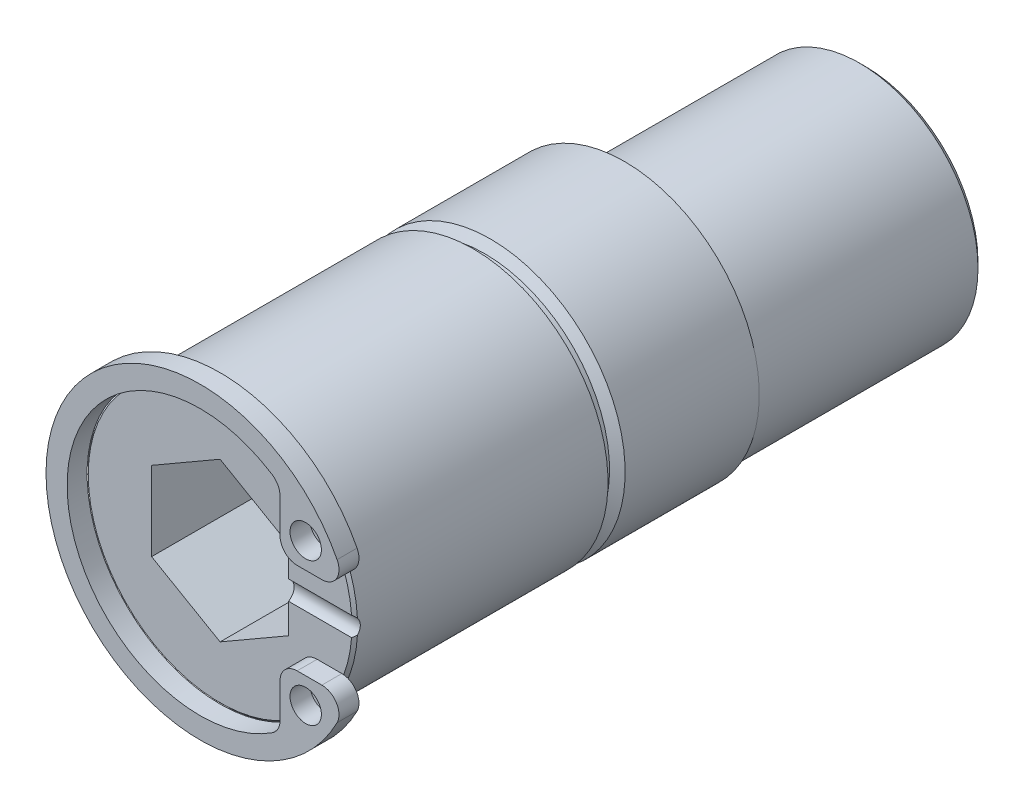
ISO-10303-21;
HEADER;
FILE_DESCRIPTION(('STEP AP214'),'2;1');
FILE_NAME('part.step','',(''),(''),'','','');
FILE_SCHEMA(('AUTOMOTIVE_DESIGN { 1 0 10303 214 1 1 1 1 }'));
ENDSEC;
DATA;
#1=APPLICATION_CONTEXT('core data for automotive mechanical design processes');
#2=APPLICATION_PROTOCOL_DEFINITION('international standard','automotive_design',2000,#1);
#3=PRODUCT_CONTEXT('',#1,'mechanical');
#4=PRODUCT('Part','Part','',(#3));
#5=PRODUCT_RELATED_PRODUCT_CATEGORY('part','',(#4));
#6=PRODUCT_DEFINITION_FORMATION('','',#4);
#7=PRODUCT_DEFINITION_CONTEXT('part definition',#1,'design');
#8=PRODUCT_DEFINITION('design','',#6,#7);
#9=PRODUCT_DEFINITION_SHAPE('','',#8);
#10=(LENGTH_UNIT() NAMED_UNIT(*) SI_UNIT(.MILLI.,.METRE.));
#11=(NAMED_UNIT(*) PLANE_ANGLE_UNIT() SI_UNIT($,.RADIAN.));
#12=(NAMED_UNIT(*) SI_UNIT($,.STERADIAN.) SOLID_ANGLE_UNIT());
#13=UNCERTAINTY_MEASURE_WITH_UNIT(LENGTH_MEASURE(1.E-05),#10,'distance_accuracy_value','');
#14=(GEOMETRIC_REPRESENTATION_CONTEXT(3) GLOBAL_UNCERTAINTY_ASSIGNED_CONTEXT((#13)) GLOBAL_UNIT_ASSIGNED_CONTEXT((#10,
#11,#12)) REPRESENTATION_CONTEXT('',''));
#15=CARTESIAN_POINT('',(0.,0.,0.));
#16=DIRECTION('',(0.,0.,1.));
#17=DIRECTION('',(1.,0.,0.));
#18=AXIS2_PLACEMENT_3D('',#15,#16,#17);
#19=CARTESIAN_POINT('',(4.31800000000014,2.79399999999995,0.));
#20=DIRECTION('',(0.,0.,1.));
#21=DIRECTION('',(0.,-1.,0.));
#22=AXIS2_PLACEMENT_3D('',#19,#20,#21);
#23=CYLINDRICAL_SURFACE('',#22,0.762);
#24=CARTESIAN_POINT('',(4.31800000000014,2.79399999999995,0.));
#25=DIRECTION('',(0.,0.,1.));
#26=DIRECTION('',(-1.,0.,0.));
#27=AXIS2_PLACEMENT_3D('',#24,#25,#26);
#28=CIRCLE('',#27,0.762);
#29=CARTESIAN_POINT('',(3.55600000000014,2.79399999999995,0.));
#30=VERTEX_POINT('',#29);
#31=CARTESIAN_POINT('',(4.31800000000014,2.03199999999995,0.));
#32=VERTEX_POINT('',#31);
#33=EDGE_CURVE('E242',#30,#32,#28,.T.);
#34=ORIENTED_EDGE('',*,*,#33,.T.);
#35=DIRECTION('',(0.,0.,1.));
#36=VECTOR('',#35,1.);
#37=CARTESIAN_POINT('',(4.31800000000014,2.032,0.));
#38=LINE('',#37,#36);
#39=CARTESIAN_POINT('',(4.31800000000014,2.032,0.889));
#40=VERTEX_POINT('',#39);
#41=EDGE_CURVE('E295',#32,#40,#38,.T.);
#42=ORIENTED_EDGE('',*,*,#41,.T.);
#43=CARTESIAN_POINT('',(4.31800000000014,2.79399999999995,0.889));
#44=DIRECTION('',(0.,0.,1.));
#45=DIRECTION('',(0.,-1.,0.));
#46=AXIS2_PLACEMENT_3D('',#43,#44,#45);
#47=CIRCLE('',#46,0.762);
#48=CARTESIAN_POINT('',(3.55600000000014,2.79399999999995,0.889));
#49=VERTEX_POINT('',#48);
#50=EDGE_CURVE('E267',#40,#49,#47,.F.);
#51=ORIENTED_EDGE('',*,*,#50,.T.);
#52=DIRECTION('',(0.,0.,1.));
#53=VECTOR('',#52,1.);
#54=CARTESIAN_POINT('',(3.55600000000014,2.79399999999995,0.));
#55=LINE('',#54,#53);
#56=EDGE_CURVE('E292',#49,#30,#55,.F.);
#57=ORIENTED_EDGE('',*,*,#56,.T.);
#58=EDGE_LOOP('',(#34,#42,#51,#57));
#59=FACE_BOUND('',#58,.T.);
#60=ADVANCED_FACE('F14',(#59),#23,.T.);
#61=CARTESIAN_POINT('',(3.55600000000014,4.33358540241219,0.));
#62=DIRECTION('',(1.,0.,0.));
#63=DIRECTION('',(0.,1.,0.));
#64=AXIS2_PLACEMENT_3D('',#61,#62,#63);
#65=PLANE('',#64);
#66=DIRECTION('',(0.,0.,1.));
#67=VECTOR('',#66,1.);
#68=CARTESIAN_POINT('',(3.55600000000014,4.33358540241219,0.));
#69=LINE('',#68,#67);
#70=CARTESIAN_POINT('',(3.55600000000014,4.33358540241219,0.889));
#71=VERTEX_POINT('',#70);
#72=CARTESIAN_POINT('',(3.55600000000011,4.33358540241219,0.));
#73=VERTEX_POINT('',#72);
#74=EDGE_CURVE('E291',#71,#73,#69,.F.);
#75=ORIENTED_EDGE('',*,*,#74,.T.);
#76=DIRECTION('',(0.,1.,0.));
#77=VECTOR('',#76,1.);
#78=CARTESIAN_POINT('',(3.55600000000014,0.,0.));
#79=LINE('',#78,#77);
#80=EDGE_CURVE('E239',#30,#73,#79,.T.);
#81=ORIENTED_EDGE('',*,*,#80,.F.);
#82=ORIENTED_EDGE('',*,*,#56,.F.);
#83=DIRECTION('',(0.,1.,0.));
#84=VECTOR('',#83,1.);
#85=CARTESIAN_POINT('',(3.55600000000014,-6.858,0.889));
#86=LINE('',#85,#84);
#87=EDGE_CURVE('E263',#49,#71,#86,.T.);
#88=ORIENTED_EDGE('',*,*,#87,.T.);
#89=EDGE_LOOP('',(#75,#81,#82,#88));
#90=FACE_BOUND('',#89,.T.);
#91=ADVANCED_FACE('F460',(#90),#65,.F.);
#92=CARTESIAN_POINT('',(3.55600000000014,-2.794,0.));
#93=DIRECTION('',(1.,0.,0.));
#94=DIRECTION('',(0.,1.,0.));
#95=AXIS2_PLACEMENT_3D('',#92,#93,#94);
#96=PLANE('',#95);
#97=DIRECTION('',(0.,0.,1.));
#98=VECTOR('',#97,1.);
#99=CARTESIAN_POINT('',(3.55600000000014,-2.794,0.));
#100=LINE('',#99,#98);
#101=CARTESIAN_POINT('',(3.55600000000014,-2.794,0.));
#102=VERTEX_POINT('',#101);
#103=CARTESIAN_POINT('',(3.55600000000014,-2.794,0.889));
#104=VERTEX_POINT('',#103);
#105=EDGE_CURVE('E280',#102,#104,#100,.T.);
#106=ORIENTED_EDGE('',*,*,#105,.F.);
#107=DIRECTION('',(0.,1.,0.));
#108=VECTOR('',#107,1.);
#109=CARTESIAN_POINT('',(3.55600000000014,0.,0.));
#110=LINE('',#109,#108);
#111=CARTESIAN_POINT('',(3.55600000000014,-4.33358540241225,0.));
#112=VERTEX_POINT('',#111);
#113=EDGE_CURVE('E228',#112,#102,#110,.T.);
#114=ORIENTED_EDGE('',*,*,#113,.F.);
#115=DIRECTION('',(0.,0.,1.));
#116=VECTOR('',#115,1.);
#117=CARTESIAN_POINT('',(3.55600000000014,-4.33358540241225,0.));
#118=LINE('',#117,#116);
#119=CARTESIAN_POINT('',(3.55600000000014,-4.33358540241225,0.889));
#120=VERTEX_POINT('',#119);
#121=EDGE_CURVE('E282',#120,#112,#118,.F.);
#122=ORIENTED_EDGE('',*,*,#121,.F.);
#123=DIRECTION('',(0.,1.,0.));
#124=VECTOR('',#123,1.);
#125=CARTESIAN_POINT('',(3.55600000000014,-6.858,0.889));
#126=LINE('',#125,#124);
#127=EDGE_CURVE('E259',#120,#104,#126,.T.);
#128=ORIENTED_EDGE('',*,*,#127,.T.);
#129=EDGE_LOOP('',(#106,#114,#122,#128));
#130=FACE_BOUND('',#129,.T.);
#131=ADVANCED_FACE('F466',(#130),#96,.F.);
#132=CARTESIAN_POINT('',(4.31800000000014,-2.794,0.));
#133=DIRECTION('',(0.,0.,1.));
#134=DIRECTION('',(1.,0.,0.));
#135=AXIS2_PLACEMENT_3D('',#132,#133,#134);
#136=CYLINDRICAL_SURFACE('',#135,0.762);
#137=CARTESIAN_POINT('',(4.31800000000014,-2.794,0.));
#138=DIRECTION('',(0.,0.,1.));
#139=DIRECTION('',(-1.,0.,0.));
#140=AXIS2_PLACEMENT_3D('',#137,#138,#139);
#141=CIRCLE('',#140,0.762);
#142=CARTESIAN_POINT('',(4.31800000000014,-2.032,0.));
#143=VERTEX_POINT('',#142);
#144=EDGE_CURVE('E224',#143,#102,#141,.T.);
#145=ORIENTED_EDGE('',*,*,#144,.T.);
#146=ORIENTED_EDGE('',*,*,#105,.T.);
#147=CARTESIAN_POINT('',(4.31800000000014,-2.794,0.889));
#148=DIRECTION('',(0.,0.,1.));
#149=DIRECTION('',(1.,0.,0.));
#150=AXIS2_PLACEMENT_3D('',#147,#148,#149);
#151=CIRCLE('',#150,0.762);
#152=CARTESIAN_POINT('',(4.31800000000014,-2.032,0.889));
#153=VERTEX_POINT('',#152);
#154=EDGE_CURVE('E258',#104,#153,#151,.F.);
#155=ORIENTED_EDGE('',*,*,#154,.T.);
#156=DIRECTION('',(0.,0.,-1.));
#157=VECTOR('',#156,1.);
#158=CARTESIAN_POINT('',(4.31800000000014,-2.032,0.));
#159=LINE('',#158,#157);
#160=EDGE_CURVE('E277',#153,#143,#159,.T.);
#161=ORIENTED_EDGE('',*,*,#160,.T.);
#162=EDGE_LOOP('',(#145,#146,#155,#161));
#163=FACE_BOUND('',#162,.T.);
#164=ADVANCED_FACE('F475',(#163),#136,.T.);
#165=CARTESIAN_POINT('',(4.31800000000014,2.032,0.));
#166=DIRECTION('',(0.,1.,0.));
#167=DIRECTION('',(0.,0.,1.));
#168=AXIS2_PLACEMENT_3D('',#165,#166,#167);
#169=PLANE('',#168);
#170=ORIENTED_EDGE('',*,*,#41,.F.);
#171=DIRECTION('',(-1.,0.,0.));
#172=VECTOR('',#171,1.);
#173=CARTESIAN_POINT('',(5.9944,2.032,0.));
#174=LINE('',#173,#172);
#175=CARTESIAN_POINT('',(5.41800516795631,2.032,0.));
#176=VERTEX_POINT('',#175);
#177=EDGE_CURVE('E244',#176,#32,#174,.T.);
#178=ORIENTED_EDGE('',*,*,#177,.F.);
#179=DIRECTION('',(0.,0.,1.));
#180=VECTOR('',#179,1.);
#181=CARTESIAN_POINT('',(5.41800516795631,2.032,0.));
#182=LINE('',#181,#180);
#183=CARTESIAN_POINT('',(5.41800516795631,2.032,0.889));
#184=VERTEX_POINT('',#183);
#185=EDGE_CURVE('E297',#184,#176,#182,.F.);
#186=ORIENTED_EDGE('',*,*,#185,.F.);
#187=DIRECTION('',(1.,0.,0.));
#188=VECTOR('',#187,1.);
#189=CARTESIAN_POINT('',(6.29140533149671,2.032,0.889));
#190=LINE('',#189,#188);
#191=EDGE_CURVE('E268',#184,#40,#190,.F.);
#192=ORIENTED_EDGE('',*,*,#191,.T.);
#193=EDGE_LOOP('',(#170,#178,#186,#192));
#194=FACE_BOUND('',#193,.T.);
#195=ADVANCED_FACE('F471',(#194),#169,.F.);
#196=CARTESIAN_POINT('',(5.41800516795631,-2.032,0.));
#197=DIRECTION('',(0.,-1.,0.));
#198=DIRECTION('',(0.,0.,-1.));
#199=AXIS2_PLACEMENT_3D('',#196,#197,#198);
#200=PLANE('',#199);
#201=DIRECTION('',(0.,0.,1.));
#202=VECTOR('',#201,1.);
#203=CARTESIAN_POINT('',(5.41800516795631,-2.032,0.));
#204=LINE('',#203,#202);
#205=CARTESIAN_POINT('',(5.41800516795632,-2.032,0.));
#206=VERTEX_POINT('',#205);
#207=CARTESIAN_POINT('',(5.4180051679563,-2.032,0.889));
#208=VERTEX_POINT('',#207);
#209=EDGE_CURVE('E275',#206,#208,#204,.T.);
#210=ORIENTED_EDGE('',*,*,#209,.F.);
#211=DIRECTION('',(1.,0.,0.));
#212=VECTOR('',#211,1.);
#213=CARTESIAN_POINT('',(5.9944,-2.032,0.));
#214=LINE('',#213,#212);
#215=EDGE_CURVE('E208',#143,#206,#214,.T.);
#216=ORIENTED_EDGE('',*,*,#215,.F.);
#217=ORIENTED_EDGE('',*,*,#160,.F.);
#218=DIRECTION('',(1.,0.,0.));
#219=VECTOR('',#218,1.);
#220=CARTESIAN_POINT('',(6.29140533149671,-2.032,0.889));
#221=LINE('',#220,#219);
#222=EDGE_CURVE('E255',#153,#208,#221,.T.);
#223=ORIENTED_EDGE('',*,*,#222,.T.);
#224=EDGE_LOOP('',(#210,#216,#217,#223));
#225=FACE_BOUND('',#224,.T.);
#226=ADVANCED_FACE('F474',(#225),#200,.F.);
#227=CARTESIAN_POINT('',(6.29140533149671,-6.858,0.889));
#228=DIRECTION('',(0.,0.,-1.));
#229=DIRECTION('',(0.,1.,0.));
#230=AXIS2_PLACEMENT_3D('',#227,#228,#229);
#231=PLANE('',#230);
#232=CARTESIAN_POINT('',(1.2659720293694E-13,0.,0.889));
#233=DIRECTION('',(0.,0.,1.));
#234=DIRECTION('',(0.,-1.,0.));
#235=AXIS2_PLACEMENT_3D('',#232,#233,#234);
#236=CIRCLE('',#235,6.858);
#237=CARTESIAN_POINT('',(6.09525581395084,-3.14325,0.889));
#238=VERTEX_POINT('',#237);
#239=CARTESIAN_POINT('',(6.09525581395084,3.14325,0.889));
#240=VERTEX_POINT('',#239);
#241=EDGE_CURVE('E317',#238,#240,#236,.F.);
#242=ORIENTED_EDGE('',*,*,#241,.F.);
#243=CARTESIAN_POINT('',(5.4180051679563,-2.794,0.889));
#244=DIRECTION('',(0.,0.,1.));
#245=DIRECTION('',(1.,0.,0.));
#246=AXIS2_PLACEMENT_3D('',#243,#244,#245);
#247=CIRCLE('',#246,0.762);
#248=EDGE_CURVE('E210',#208,#238,#247,.F.);
#249=ORIENTED_EDGE('',*,*,#248,.F.);
#250=ORIENTED_EDGE('',*,*,#222,.F.);
#251=ORIENTED_EDGE('',*,*,#154,.F.);
#252=ORIENTED_EDGE('',*,*,#127,.F.);
#253=CARTESIAN_POINT('',(2.79400000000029,-4.33358540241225,0.889));
#254=DIRECTION('',(0.,0.,1.));
#255=DIRECTION('',(1.,0.,0.));
#256=AXIS2_PLACEMENT_3D('',#253,#254,#255);
#257=CIRCLE('',#256,0.761999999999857);
#258=CARTESIAN_POINT('',(3.2069064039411,-4.97401674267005,0.889));
#259=VERTEX_POINT('',#258);
#260=EDGE_CURVE('E262',#259,#120,#257,.T.);
#261=ORIENTED_EDGE('',*,*,#260,.F.);
#262=CARTESIAN_POINT('',(1.25005070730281E-13,0.,0.889));
#263=DIRECTION('',(0.,0.,1.));
#264=DIRECTION('',(0.,-1.,0.));
#265=AXIS2_PLACEMENT_3D('',#262,#263,#264);
#266=CIRCLE('',#265,5.9182);
#267=CARTESIAN_POINT('',(3.20690640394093,4.9740167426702,0.889));
#268=VERTEX_POINT('',#267);
#269=EDGE_CURVE('E309',#268,#259,#266,.T.);
#270=ORIENTED_EDGE('',*,*,#269,.F.);
#271=CARTESIAN_POINT('',(2.794,4.33358540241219,0.889));
#272=DIRECTION('',(0.,0.,1.));
#273=DIRECTION('',(1.,0.,0.));
#274=AXIS2_PLACEMENT_3D('',#271,#272,#273);
#275=CIRCLE('',#274,0.762000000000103);
#276=EDGE_CURVE('E266',#71,#268,#275,.T.);
#277=ORIENTED_EDGE('',*,*,#276,.F.);
#278=ORIENTED_EDGE('',*,*,#87,.F.);
#279=ORIENTED_EDGE('',*,*,#50,.F.);
#280=ORIENTED_EDGE('',*,*,#191,.F.);
#281=CARTESIAN_POINT('',(5.41800516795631,2.794,0.889));
#282=DIRECTION('',(0.,0.,1.));
#283=DIRECTION('',(0.,-1.,0.));
#284=AXIS2_PLACEMENT_3D('',#281,#282,#283);
#285=CIRCLE('',#284,0.762);
#286=EDGE_CURVE('E271',#240,#184,#285,.F.);
#287=ORIENTED_EDGE('',*,*,#286,.F.);
#288=EDGE_LOOP('',(#242,#249,#250,#251,#252,#261,#270,#277,#278,#279,#280,#287));
#289=FACE_BOUND('',#288,.T.);
#290=CARTESIAN_POINT('',(4.69900000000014,3.175,0.889));
#291=DIRECTION('',(0.,0.,-1.));
#292=DIRECTION('',(0.,1.,0.));
#293=AXIS2_PLACEMENT_3D('',#290,#291,#292);
#294=CIRCLE('',#293,0.6985);
#295=CARTESIAN_POINT('',(4.69900000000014,3.8735,0.889000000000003));
#296=VERTEX_POINT('',#295);
#297=EDGE_CURVE('E319',#296,#296,#294,.F.);
#298=ORIENTED_EDGE('',*,*,#297,.F.);
#299=EDGE_LOOP('',(#298));
#300=FACE_BOUND('',#299,.T.);
#301=CARTESIAN_POINT('',(4.69900000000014,-3.175,0.889));
#302=DIRECTION('',(0.,0.,-1.));
#303=DIRECTION('',(0.,1.,0.));
#304=AXIS2_PLACEMENT_3D('',#301,#302,#303);
#305=CIRCLE('',#304,0.6985);
#306=CARTESIAN_POINT('',(4.69900000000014,-2.4765,0.889000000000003));
#307=VERTEX_POINT('',#306);
#308=EDGE_CURVE('E273',#307,#307,#305,.F.);
#309=ORIENTED_EDGE('',*,*,#308,.F.);
#310=EDGE_LOOP('',(#309));
#311=FACE_BOUND('',#310,.T.);
#312=ADVANCED_FACE('F591',(#289,#300,#311),#231,.F.);
#313=CARTESIAN_POINT('',(1.25005070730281E-13,0.,0.));
#314=DIRECTION('',(0.,0.,1.));
#315=DIRECTION('',(0.,-1.,0.));
#316=AXIS2_PLACEMENT_3D('',#313,#314,#315);
#317=CYLINDRICAL_SURFACE('',#316,5.9182);
#318=CARTESIAN_POINT('',(1.25005070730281E-13,0.,0.));
#319=DIRECTION('',(0.,0.,1.));
#320=DIRECTION('',(-1.,0.,0.));
#321=AXIS2_PLACEMENT_3D('',#318,#319,#320);
#322=CIRCLE('',#321,5.9182);
#323=CARTESIAN_POINT('',(3.20690640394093,4.9740167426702,0.));
#324=VERTEX_POINT('',#323);
#325=CARTESIAN_POINT('',(3.20690640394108,-4.97401674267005,0.));
#326=VERTEX_POINT('',#325);
#327=EDGE_CURVE('E234',#324,#326,#322,.T.);
#328=ORIENTED_EDGE('',*,*,#327,.F.);
#329=DIRECTION('',(0.,0.,1.));
#330=VECTOR('',#329,1.);
#331=CARTESIAN_POINT('',(3.20690640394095,4.97401674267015,0.));
#332=LINE('',#331,#330);
#333=EDGE_CURVE('E288',#268,#324,#332,.F.);
#334=ORIENTED_EDGE('',*,*,#333,.F.);
#335=ORIENTED_EDGE('',*,*,#269,.T.);
#336=DIRECTION('',(0.,0.,1.));
#337=VECTOR('',#336,1.);
#338=CARTESIAN_POINT('',(3.20690640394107,-4.9740167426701,0.));
#339=LINE('',#338,#337);
#340=EDGE_CURVE('E285',#259,#326,#339,.F.);
#341=ORIENTED_EDGE('',*,*,#340,.T.);
#342=EDGE_LOOP('',(#328,#334,#335,#341));
#343=FACE_BOUND('',#342,.T.);
#344=ADVANCED_FACE('F600',(#343),#317,.F.);
#345=CARTESIAN_POINT('',(2.794,4.33358540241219,0.));
#346=DIRECTION('',(0.,0.,1.));
#347=DIRECTION('',(1.,0.,0.));
#348=AXIS2_PLACEMENT_3D('',#345,#346,#347);
#349=CYLINDRICAL_SURFACE('',#348,0.762000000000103);
#350=ORIENTED_EDGE('',*,*,#333,.T.);
#351=CARTESIAN_POINT('',(2.794,4.33358540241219,0.));
#352=DIRECTION('',(0.,0.,1.));
#353=DIRECTION('',(-1.,0.,0.));
#354=AXIS2_PLACEMENT_3D('',#351,#352,#353);
#355=CIRCLE('',#354,0.762000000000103);
#356=CARTESIAN_POINT('',(3.42063754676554,4.76713976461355,0.));
#357=VERTEX_POINT('',#356);
#358=EDGE_CURVE('E236',#357,#324,#355,.T.);
#359=ORIENTED_EDGE('',*,*,#358,.F.);
#360=EDGE_CURVE('E237',#73,#357,#355,.T.);
#361=ORIENTED_EDGE('',*,*,#360,.F.);
#362=ORIENTED_EDGE('',*,*,#74,.F.);
#363=ORIENTED_EDGE('',*,*,#276,.T.);
#364=EDGE_LOOP('',(#350,#359,#361,#362,#363));
#365=FACE_BOUND('',#364,.T.);
#366=ADVANCED_FACE('F485',(#365),#349,.F.);
#367=CARTESIAN_POINT('',(4.69900000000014,3.175,0.889));
#368=DIRECTION('',(0.,0.,-1.));
#369=DIRECTION('',(0.,1.,0.));
#370=AXIS2_PLACEMENT_3D('',#367,#368,#369);
#371=CYLINDRICAL_SURFACE('',#370,0.6985);
#372=CARTESIAN_POINT('',(4.69900000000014,3.175,0.));
#373=DIRECTION('',(0.,0.,1.));
#374=DIRECTION('',(-1.,0.,0.));
#375=AXIS2_PLACEMENT_3D('',#372,#373,#374);
#376=CIRCLE('',#375,0.6985);
#377=CARTESIAN_POINT('',(5.20992876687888,2.69870802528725,0.));
#378=VERTEX_POINT('',#377);
#379=CARTESIAN_POINT('',(4.44774164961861,3.82674495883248,0.));
#380=VERTEX_POINT('',#379);
#381=EDGE_CURVE('E250',#378,#380,#376,.T.);
#382=ORIENTED_EDGE('',*,*,#381,.F.);
#383=EDGE_CURVE('E33',#380,#378,#376,.T.);
#384=ORIENTED_EDGE('',*,*,#383,.F.);
#385=EDGE_LOOP('',(#382,#384));
#386=FACE_BOUND('',#385,.T.);
#387=ORIENTED_EDGE('',*,*,#297,.T.);
#388=EDGE_LOOP('',(#387));
#389=FACE_BOUND('',#388,.T.);
#390=ADVANCED_FACE('F481',(#386,#389),#371,.F.);
#391=CARTESIAN_POINT('',(5.41800516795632,2.794,0.));
#392=DIRECTION('',(0.,0.,1.));
#393=DIRECTION('',(0.,-1.,0.));
#394=AXIS2_PLACEMENT_3D('',#391,#392,#393);
#395=CYLINDRICAL_SURFACE('',#394,0.762);
#396=CARTESIAN_POINT('',(5.41800516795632,2.794,0.));
#397=DIRECTION('',(0.,0.,1.));
#398=DIRECTION('',(-1.,0.,0.));
#399=AXIS2_PLACEMENT_3D('',#396,#397,#398);
#400=CIRCLE('',#399,0.762);
#401=CARTESIAN_POINT('',(5.50256398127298,2.03670626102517,0.));
#402=VERTEX_POINT('',#401);
#403=EDGE_CURVE('E248',#176,#402,#400,.T.);
#404=ORIENTED_EDGE('',*,*,#403,.T.);
#405=CARTESIAN_POINT('',(6.09525581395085,3.14325,0.));
#406=VERTEX_POINT('',#405);
#407=EDGE_CURVE('E247',#402,#406,#400,.T.);
#408=ORIENTED_EDGE('',*,*,#407,.T.);
#409=DIRECTION('',(0.,0.,1.));
#410=VECTOR('',#409,1.);
#411=CARTESIAN_POINT('',(6.09525581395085,3.14325,0.));
#412=LINE('',#411,#410);
#413=EDGE_CURVE('E300',#406,#240,#412,.T.);
#414=ORIENTED_EDGE('',*,*,#413,.T.);
#415=ORIENTED_EDGE('',*,*,#286,.T.);
#416=ORIENTED_EDGE('',*,*,#185,.T.);
#417=EDGE_LOOP('',(#404,#408,#414,#415,#416));
#418=FACE_BOUND('',#417,.T.);
#419=ADVANCED_FACE('F477',(#418),#395,.T.);
#420=CARTESIAN_POINT('',(1.2659720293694E-13,0.,0.));
#421=DIRECTION('',(0.,0.,1.));
#422=DIRECTION('',(0.,-1.,0.));
#423=AXIS2_PLACEMENT_3D('',#420,#421,#422);
#424=CYLINDRICAL_SURFACE('',#423,6.858);
#425=DIRECTION('',(0.,0.,1.));
#426=VECTOR('',#425,1.);
#427=CARTESIAN_POINT('',(6.09525581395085,-3.14325,0.));
#428=LINE('',#427,#426);
#429=CARTESIAN_POINT('',(6.09525581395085,-3.14325,0.));
#430=VERTEX_POINT('',#429);
#431=EDGE_CURVE('E223',#430,#238,#428,.T.);
#432=ORIENTED_EDGE('',*,*,#431,.T.);
#433=ORIENTED_EDGE('',*,*,#241,.T.);
#434=ORIENTED_EDGE('',*,*,#413,.F.);
#435=CARTESIAN_POINT('',(1.2659720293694E-13,0.,0.));
#436=DIRECTION('',(0.,0.,1.));
#437=DIRECTION('',(0.,-1.,0.));
#438=AXIS2_PLACEMENT_3D('',#435,#436,#437);
#439=CIRCLE('',#438,6.858);
#440=EDGE_CURVE('E274',#406,#430,#439,.T.);
#441=ORIENTED_EDGE('',*,*,#440,.T.);
#442=EDGE_LOOP('',(#432,#433,#434,#441));
#443=FACE_BOUND('',#442,.T.);
#444=ADVANCED_FACE('F480',(#443),#424,.T.);
#445=CARTESIAN_POINT('',(5.41800516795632,-2.794,0.));
#446=DIRECTION('',(0.,0.,1.));
#447=DIRECTION('',(1.,0.,0.));
#448=AXIS2_PLACEMENT_3D('',#445,#446,#447);
#449=CYLINDRICAL_SURFACE('',#448,0.762);
#450=ORIENTED_EDGE('',*,*,#248,.T.);
#451=ORIENTED_EDGE('',*,*,#431,.F.);
#452=CARTESIAN_POINT('',(5.41800516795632,-2.794,0.));
#453=DIRECTION('',(0.,0.,1.));
#454=DIRECTION('',(-1.,0.,0.));
#455=AXIS2_PLACEMENT_3D('',#452,#453,#454);
#456=CIRCLE('',#455,0.762);
#457=CARTESIAN_POINT('',(5.50256398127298,-2.03670626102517,0.));
#458=VERTEX_POINT('',#457);
#459=EDGE_CURVE('E193',#430,#458,#456,.T.);
#460=ORIENTED_EDGE('',*,*,#459,.T.);
#461=EDGE_CURVE('E102',#458,#206,#456,.T.);
#462=ORIENTED_EDGE('',*,*,#461,.T.);
#463=ORIENTED_EDGE('',*,*,#209,.T.);
#464=EDGE_LOOP('',(#450,#451,#460,#462,#463));
#465=FACE_BOUND('',#464,.T.);
#466=ADVANCED_FACE('F221',(#465),#449,.T.);
#467=CARTESIAN_POINT('',(4.69900000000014,-3.175,0.889));
#468=DIRECTION('',(0.,0.,-1.));
#469=DIRECTION('',(0.,1.,0.));
#470=AXIS2_PLACEMENT_3D('',#467,#468,#469);
#471=CYLINDRICAL_SURFACE('',#470,0.6985);
#472=ORIENTED_EDGE('',*,*,#308,.T.);
#473=EDGE_LOOP('',(#472));
#474=FACE_BOUND('',#473,.T.);
#475=CARTESIAN_POINT('',(4.69900000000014,-3.175,0.));
#476=DIRECTION('',(0.,0.,1.));
#477=DIRECTION('',(-1.,0.,0.));
#478=AXIS2_PLACEMENT_3D('',#475,#476,#477);
#479=CIRCLE('',#478,0.6985);
#480=CARTESIAN_POINT('',(4.44774164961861,-3.82674495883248,0.));
#481=VERTEX_POINT('',#480);
#482=CARTESIAN_POINT('',(5.20992876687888,-2.69870802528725,0.));
#483=VERTEX_POINT('',#482);
#484=EDGE_CURVE('E196',#481,#483,#479,.T.);
#485=ORIENTED_EDGE('',*,*,#484,.F.);
#486=EDGE_CURVE('E253',#483,#481,#479,.T.);
#487=ORIENTED_EDGE('',*,*,#486,.F.);
#488=EDGE_LOOP('',(#485,#487));
#489=FACE_BOUND('',#488,.T.);
#490=ADVANCED_FACE('F486',(#474,#489),#471,.F.);
#491=CARTESIAN_POINT('',(2.79400000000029,-4.3335854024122,0.));
#492=DIRECTION('',(0.,0.,1.));
#493=DIRECTION('',(1.,0.,0.));
#494=AXIS2_PLACEMENT_3D('',#491,#492,#493);
#495=CYLINDRICAL_SURFACE('',#494,0.761999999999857);
#496=ORIENTED_EDGE('',*,*,#121,.T.);
#497=CARTESIAN_POINT('',(2.79400000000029,-4.3335854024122,0.));
#498=DIRECTION('',(0.,0.,1.));
#499=DIRECTION('',(-1.,0.,0.));
#500=AXIS2_PLACEMENT_3D('',#497,#498,#499);
#501=CIRCLE('',#500,0.761999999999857);
#502=CARTESIAN_POINT('',(3.42063754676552,-4.76713976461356,0.));
#503=VERTEX_POINT('',#502);
#504=EDGE_CURVE('E231',#503,#112,#501,.T.);
#505=ORIENTED_EDGE('',*,*,#504,.F.);
#506=EDGE_CURVE('E232',#326,#503,#501,.T.);
#507=ORIENTED_EDGE('',*,*,#506,.F.);
#508=ORIENTED_EDGE('',*,*,#340,.F.);
#509=ORIENTED_EDGE('',*,*,#260,.T.);
#510=EDGE_LOOP('',(#496,#505,#507,#508,#509));
#511=FACE_BOUND('',#510,.T.);
#512=ADVANCED_FACE('F457',(#511),#495,.F.);
#513=CARTESIAN_POINT('',(-7.69597987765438,-6.858,0.));
#514=DIRECTION('',(0.,0.,1.));
#515=DIRECTION('',(0.,-1.,0.));
#516=AXIS2_PLACEMENT_3D('',#513,#514,#515);
#517=PLANE('',#516);
#518=ORIENTED_EDGE('',*,*,#506,.T.);
#519=CARTESIAN_POINT('',(0.,0.,0.));
#520=DIRECTION('',(0.,0.,1.));
#521=DIRECTION('',(0.,-1.,0.));
#522=AXIS2_PLACEMENT_3D('',#519,#520,#521);
#523=CIRCLE('',#522,5.86740000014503);
#524=EDGE_CURVE('E9',#503,#481,#523,.T.);
#525=ORIENTED_EDGE('',*,*,#524,.T.);
#526=ORIENTED_EDGE('',*,*,#484,.T.);
#527=EDGE_CURVE('E24',#483,#458,#523,.T.);
#528=ORIENTED_EDGE('',*,*,#527,.T.);
#529=ORIENTED_EDGE('',*,*,#459,.F.);
#530=ORIENTED_EDGE('',*,*,#440,.F.);
#531=ORIENTED_EDGE('',*,*,#407,.F.);
#532=EDGE_CURVE('E200',#402,#378,#523,.T.);
#533=ORIENTED_EDGE('',*,*,#532,.T.);
#534=ORIENTED_EDGE('',*,*,#381,.T.);
#535=EDGE_CURVE('E26',#380,#357,#523,.T.);
#536=ORIENTED_EDGE('',*,*,#535,.T.);
#537=ORIENTED_EDGE('',*,*,#358,.T.);
#538=ORIENTED_EDGE('',*,*,#327,.T.);
#539=EDGE_LOOP('',(#518,#525,#526,#528,#529,#530,#531,#533,#534,#536,#537,#538));
#540=FACE_BOUND('',#539,.T.);
#541=ADVANCED_FACE('F191',(#540),#517,.F.);
#542=CARTESIAN_POINT('',(0.7112,0.,-28.));
#543=DIRECTION('',(0.,0.,-1.));
#544=DIRECTION('',(0.,1.,0.));
#545=AXIS2_PLACEMENT_3D('',#542,#543,#544);
#546=PLANE('',#545);
#547=CARTESIAN_POINT('',(0.7112,0.,-27.9999999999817));
#548=DIRECTION('',(0.,0.,1.));
#549=DIRECTION('',(1.,0.,0.));
#550=AXIS2_PLACEMENT_3D('',#547,#548,#549);
#551=CIRCLE('',#550,5.01650000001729);
#552=CARTESIAN_POINT('',(5.72770000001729,0.,-27.9999999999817));
#553=VERTEX_POINT('',#552);
#554=EDGE_CURVE('E18',#553,#553,#551,.T.);
#555=ORIENTED_EDGE('',*,*,#554,.F.);
#556=EDGE_LOOP('',(#555));
#557=FACE_BOUND('',#556,.T.);
#558=ADVANCED_FACE('F16',(#557),#546,.T.);
#559=CARTESIAN_POINT('',(0.7112,0.,-27.7459999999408));
#560=DIRECTION('',(0.,0.,1.));
#561=DIRECTION('',(1.,0.,0.));
#562=AXIS2_PLACEMENT_3D('',#559,#560,#561);
#563=CONICAL_SURFACE('',#562,5.27050000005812,0.785398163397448);
#564=CARTESIAN_POINT('',(0.7112,0.,-27.746));
#565=DIRECTION('',(0.,0.,1.));
#566=DIRECTION('',(0.,-1.,0.));
#567=AXIS2_PLACEMENT_3D('',#564,#565,#566);
#568=CIRCLE('',#567,5.2705);
#569=CARTESIAN_POINT('',(0.711199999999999,-5.2705,-27.746));
#570=VERTEX_POINT('',#569);
#571=EDGE_CURVE('E396',#570,#570,#568,.T.);
#572=ORIENTED_EDGE('',*,*,#571,.F.);
#573=EDGE_LOOP('',(#572));
#574=FACE_BOUND('',#573,.T.);
#575=ORIENTED_EDGE('',*,*,#554,.T.);
#576=EDGE_LOOP('',(#575));
#577=FACE_BOUND('',#576,.T.);
#578=ADVANCED_FACE('F443',(#574,#577),#563,.T.);
#579=CARTESIAN_POINT('',(0.7112,0.,-28.));
#580=DIRECTION('',(0.,0.,1.));
#581=DIRECTION('',(0.,-1.,0.));
#582=AXIS2_PLACEMENT_3D('',#579,#580,#581);
#583=CYLINDRICAL_SURFACE('',#582,5.2705);
#584=CARTESIAN_POINT('',(0.7112,0.,-18.));
#585=DIRECTION('',(0.,0.,1.));
#586=DIRECTION('',(0.,-1.,0.));
#587=AXIS2_PLACEMENT_3D('',#584,#585,#586);
#588=CIRCLE('',#587,5.2705);
#589=CARTESIAN_POINT('',(0.711199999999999,-5.2705,-18.));
#590=VERTEX_POINT('',#589);
#591=EDGE_CURVE('E383',#590,#590,#588,.T.);
#592=ORIENTED_EDGE('',*,*,#591,.F.);
#593=EDGE_LOOP('',(#592));
#594=FACE_BOUND('',#593,.T.);
#595=ORIENTED_EDGE('',*,*,#571,.T.);
#596=EDGE_LOOP('',(#595));
#597=FACE_BOUND('',#596,.T.);
#598=ADVANCED_FACE('F440',(#594,#597),#583,.T.);
#599=CARTESIAN_POINT('',(0.,0.,-18.));
#600=DIRECTION('',(0.,0.,-1.));
#601=DIRECTION('',(0.,1.,0.));
#602=AXIS2_PLACEMENT_3D('',#599,#600,#601);
#603=PLANE('',#602);
#604=ORIENTED_EDGE('',*,*,#591,.T.);
#605=EDGE_LOOP('',(#604));
#606=FACE_BOUND('',#605,.T.);
#607=CARTESIAN_POINT('',(0.,0.,-18.));
#608=DIRECTION('',(0.,0.,-1.));
#609=DIRECTION('',(0.,1.,0.));
#610=AXIS2_PLACEMENT_3D('',#607,#608,#609);
#611=CIRCLE('',#610,5.9944);
#612=CARTESIAN_POINT('',(0.,5.9944,-18.));
#613=VERTEX_POINT('',#612);
#614=EDGE_CURVE('E378',#613,#613,#611,.F.);
#615=ORIENTED_EDGE('',*,*,#614,.F.);
#616=EDGE_LOOP('',(#615));
#617=FACE_BOUND('',#616,.T.);
#618=ADVANCED_FACE('F437',(#606,#617),#603,.T.);
#619=CARTESIAN_POINT('',(0.,0.,-1.44704514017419));
#620=DIRECTION('',(0.,0.,-1.));
#621=DIRECTION('',(0.,1.,0.));
#622=AXIS2_PLACEMENT_3D('',#619,#620,#621);
#623=CYLINDRICAL_SURFACE('',#622,5.9944);
#624=CARTESIAN_POINT('',(0.,0.,-12.0310000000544));
#625=DIRECTION('',(0.,0.,-1.));
#626=DIRECTION('',(0.,1.,0.));
#627=AXIS2_PLACEMENT_3D('',#624,#625,#626);
#628=CIRCLE('',#627,5.9944000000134);
#629=CARTESIAN_POINT('',(0.,5.9944000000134,-12.0310000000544));
#630=VERTEX_POINT('',#629);
#631=EDGE_CURVE('E352',#630,#630,#628,.F.);
#632=ORIENTED_EDGE('',*,*,#631,.F.);
#633=EDGE_LOOP('',(#632));
#634=FACE_BOUND('',#633,.T.);
#635=ORIENTED_EDGE('',*,*,#614,.T.);
#636=EDGE_LOOP('',(#635));
#637=FACE_BOUND('',#636,.T.);
#638=ADVANCED_FACE('F500',(#634,#637),#623,.T.);
#639=CARTESIAN_POINT('',(0.,0.,-12.0309999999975));
#640=DIRECTION('',(0.,0.,-1.));
#641=DIRECTION('',(0.,1.,0.));
#642=AXIS2_PLACEMENT_3D('',#639,#640,#641);
#643=CONICAL_SURFACE('',#642,5.99439999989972,1.04719755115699);
#644=ORIENTED_EDGE('',*,*,#631,.T.);
#645=EDGE_LOOP('',(#644));
#646=FACE_BOUND('',#645,.T.);
#647=CARTESIAN_POINT('',(0.,0.,-11.777));
#648=DIRECTION('',(0.,0.,-1.));
#649=DIRECTION('',(0.,1.,0.));
#650=AXIS2_PLACEMENT_3D('',#647,#648,#649);
#651=CIRCLE('',#650,5.55445909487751);
#652=CARTESIAN_POINT('',(0.,5.55445909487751,-11.777));
#653=VERTEX_POINT('',#652);
#654=EDGE_CURVE('E386',#653,#653,#651,.F.);
#655=ORIENTED_EDGE('',*,*,#654,.F.);
#656=EDGE_LOOP('',(#655));
#657=FACE_BOUND('',#656,.T.);
#658=ADVANCED_FACE('F696',(#646,#657),#643,.T.);
#659=CARTESIAN_POINT('',(0.,0.,-1.44704514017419));
#660=DIRECTION('',(0.,0.,-1.));
#661=DIRECTION('',(0.,1.,0.));
#662=AXIS2_PLACEMENT_3D('',#659,#660,#661);
#663=CYLINDRICAL_SURFACE('',#662,5.55445909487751);
#664=ORIENTED_EDGE('',*,*,#654,.T.);
#665=EDGE_LOOP('',(#664));
#666=FACE_BOUND('',#665,.T.);
#667=CARTESIAN_POINT('',(0.,0.,-11.5229999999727));
#668=DIRECTION('',(0.,0.,1.));
#669=DIRECTION('',(0.,-1.,0.));
#670=AXIS2_PLACEMENT_3D('',#667,#668,#669);
#671=CIRCLE('',#670,5.55445909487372);
#672=CARTESIAN_POINT('',(0.,-5.55445909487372,-11.5229999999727));
#673=VERTEX_POINT('',#672);
#674=EDGE_CURVE('E216',#673,#673,#671,.T.);
#675=ORIENTED_EDGE('',*,*,#674,.F.);
#676=EDGE_LOOP('',(#675));
#677=FACE_BOUND('',#676,.T.);
#678=ADVANCED_FACE('F423',(#666,#677),#663,.T.);
#679=CARTESIAN_POINT('',(0.,-27.6098,-6.096));
#680=DIRECTION('',(0.,0.,1.));
#681=DIRECTION('',(0.,-1.,0.));
#682=AXIS2_PLACEMENT_3D('',#679,#680,#681);
#683=PLANE('',#682);
#684=DIRECTION('',(0.,-1.,0.));
#685=VECTOR('',#684,1.);
#686=CARTESIAN_POINT('',(3.048,-27.6098,-6.096));
#687=LINE('',#686,#685);
#688=CARTESIAN_POINT('',(3.04800000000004,-1.75976362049,-6.096));
#689=VERTEX_POINT('',#688);
#690=CARTESIAN_POINT('',(3.04800000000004,1.75976362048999,-6.096));
#691=VERTEX_POINT('',#690);
#692=EDGE_CURVE('E375',#689,#691,#687,.F.);
#693=ORIENTED_EDGE('',*,*,#692,.T.);
#694=DIRECTION('',(-0.866025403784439,0.5,0.));
#695=VECTOR('',#694,1.);
#696=CARTESIAN_POINT('',(3.04800000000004,1.75976362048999,-6.096));
#697=LINE('',#696,#695);
#698=CARTESIAN_POINT('',(0.,3.51952724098,-6.096));
#699=VERTEX_POINT('',#698);
#700=EDGE_CURVE('E355',#691,#699,#697,.T.);
#701=ORIENTED_EDGE('',*,*,#700,.T.);
#702=DIRECTION('',(-0.866025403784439,-0.5,0.));
#703=VECTOR('',#702,1.);
#704=CARTESIAN_POINT('',(0.,3.51952724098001,-6.096));
#705=LINE('',#704,#703);
#706=CARTESIAN_POINT('',(-3.04800000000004,1.75976362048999,-6.096));
#707=VERTEX_POINT('',#706);
#708=EDGE_CURVE('E360',#699,#707,#705,.T.);
#709=ORIENTED_EDGE('',*,*,#708,.T.);
#710=DIRECTION('',(0.,-1.,0.));
#711=VECTOR('',#710,1.);
#712=CARTESIAN_POINT('',(-3.04800000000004,1.75976362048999,-6.096));
#713=LINE('',#712,#711);
#714=CARTESIAN_POINT('',(-3.04800000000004,-1.75976362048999,-6.096));
#715=VERTEX_POINT('',#714);
#716=EDGE_CURVE('E364',#707,#715,#713,.T.);
#717=ORIENTED_EDGE('',*,*,#716,.T.);
#718=DIRECTION('',(0.866025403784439,-0.5,0.));
#719=VECTOR('',#718,1.);
#720=CARTESIAN_POINT('',(-3.04800000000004,-1.75976362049,-6.096));
#721=LINE('',#720,#719);
#722=CARTESIAN_POINT('',(0.,-3.51952724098,-6.096));
#723=VERTEX_POINT('',#722);
#724=EDGE_CURVE('E368',#715,#723,#721,.T.);
#725=ORIENTED_EDGE('',*,*,#724,.T.);
#726=DIRECTION('',(0.866025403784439,0.5,0.));
#727=VECTOR('',#726,1.);
#728=CARTESIAN_POINT('',(0.,-3.51952724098,-6.096));
#729=LINE('',#728,#727);
#730=EDGE_CURVE('E371',#723,#689,#729,.T.);
#731=ORIENTED_EDGE('',*,*,#730,.T.);
#732=EDGE_LOOP('',(#693,#701,#709,#717,#725,#731));
#733=FACE_BOUND('',#732,.T.);
#734=ADVANCED_FACE('F504',(#733),#683,.T.);
#735=CARTESIAN_POINT('',(0.,0.,-11.2689999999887));
#736=DIRECTION('',(0.,0.,1.));
#737=DIRECTION('',(0.,-1.,0.));
#738=AXIS2_PLACEMENT_3D('',#735,#736,#737);
#739=CONICAL_SURFACE('',#738,5.99439999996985,1.04719755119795);
#740=CARTESIAN_POINT('',(0.,0.,-11.269));
#741=DIRECTION('',(0.,0.,-1.));
#742=DIRECTION('',(0.,1.,0.));
#743=AXIS2_PLACEMENT_3D('',#740,#741,#742);
#744=CIRCLE('',#743,5.9944);
#745=CARTESIAN_POINT('',(0.,5.9944,-11.269));
#746=VERTEX_POINT('',#745);
#747=EDGE_CURVE('E303',#746,#746,#744,.F.);
#748=ORIENTED_EDGE('',*,*,#747,.F.);
#749=EDGE_LOOP('',(#748));
#750=FACE_BOUND('',#749,.T.);
#751=ORIENTED_EDGE('',*,*,#674,.T.);
#752=EDGE_LOOP('',(#751));
#753=FACE_BOUND('',#752,.T.);
#754=ADVANCED_FACE('F424',(#750,#753),#739,.T.);
#755=CARTESIAN_POINT('',(3.04800000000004,1.75976362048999,-6.096));
#756=DIRECTION('',(0.5,0.866025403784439,0.));
#757=DIRECTION('',(-0.866025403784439,0.5,0.));
#758=AXIS2_PLACEMENT_3D('',#755,#756,#757);
#759=PLANE('',#758);
#760=DIRECTION('',(0.,0.,1.));
#761=VECTOR('',#760,1.);
#762=CARTESIAN_POINT('',(0.,3.51952724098,-6.096));
#763=LINE('',#762,#761);
#764=CARTESIAN_POINT('',(0.,3.51952724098,0.));
#765=VERTEX_POINT('',#764);
#766=EDGE_CURVE('E353',#699,#765,#763,.T.);
#767=ORIENTED_EDGE('',*,*,#766,.F.);
#768=ORIENTED_EDGE('',*,*,#700,.F.);
#769=DIRECTION('',(0.,0.,1.));
#770=VECTOR('',#769,1.);
#771=CARTESIAN_POINT('',(3.04800000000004,1.75976362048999,-6.096));
#772=LINE('',#771,#770);
#773=CARTESIAN_POINT('',(3.04800000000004,1.75976362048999,0.));
#774=VERTEX_POINT('',#773);
#775=EDGE_CURVE('E357',#774,#691,#772,.F.);
#776=ORIENTED_EDGE('',*,*,#775,.F.);
#777=DIRECTION('',(0.866025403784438,-0.5,0.));
#778=VECTOR('',#777,1.);
#779=CARTESIAN_POINT('',(0.,3.51952724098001,0.));
#780=LINE('',#779,#778);
#781=EDGE_CURVE('E339',#765,#774,#780,.T.);
#782=ORIENTED_EDGE('',*,*,#781,.F.);
#783=EDGE_LOOP('',(#767,#768,#776,#782));
#784=FACE_BOUND('',#783,.T.);
#785=ADVANCED_FACE('F508',(#784),#759,.F.);
#786=CARTESIAN_POINT('',(0.,3.51952724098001,-6.096));
#787=DIRECTION('',(-0.5,0.866025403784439,0.));
#788=DIRECTION('',(-0.866025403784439,-0.5,0.));
#789=AXIS2_PLACEMENT_3D('',#786,#787,#788);
#790=PLANE('',#789);
#791=DIRECTION('',(0.,0.,1.));
#792=VECTOR('',#791,1.);
#793=CARTESIAN_POINT('',(-3.04800000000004,1.75976362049,-6.096));
#794=LINE('',#793,#792);
#795=CARTESIAN_POINT('',(-3.04800000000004,1.75976362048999,0.));
#796=VERTEX_POINT('',#795);
#797=EDGE_CURVE('E358',#707,#796,#794,.T.);
#798=ORIENTED_EDGE('',*,*,#797,.F.);
#799=ORIENTED_EDGE('',*,*,#708,.F.);
#800=ORIENTED_EDGE('',*,*,#766,.T.);
#801=DIRECTION('',(0.866025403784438,0.5,0.));
#802=VECTOR('',#801,1.);
#803=CARTESIAN_POINT('',(-3.04800000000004,1.75976362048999,0.));
#804=LINE('',#803,#802);
#805=EDGE_CURVE('E336',#796,#765,#804,.T.);
#806=ORIENTED_EDGE('',*,*,#805,.F.);
#807=EDGE_LOOP('',(#798,#799,#800,#806));
#808=FACE_BOUND('',#807,.T.);
#809=ADVANCED_FACE('F725',(#808),#790,.F.);
#810=CARTESIAN_POINT('',(-3.04800000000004,1.75976362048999,-6.096));
#811=DIRECTION('',(-1.,0.,0.));
#812=DIRECTION('',(0.,-1.,0.));
#813=AXIS2_PLACEMENT_3D('',#810,#811,#812);
#814=PLANE('',#813);
#815=DIRECTION('',(0.,0.,1.));
#816=VECTOR('',#815,1.);
#817=CARTESIAN_POINT('',(-3.04800000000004,-1.75976362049,-6.096));
#818=LINE('',#817,#816);
#819=CARTESIAN_POINT('',(-3.04800000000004,-1.75976362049,0.));
#820=VERTEX_POINT('',#819);
#821=EDGE_CURVE('E362',#715,#820,#818,.T.);
#822=ORIENTED_EDGE('',*,*,#821,.F.);
#823=ORIENTED_EDGE('',*,*,#716,.F.);
#824=ORIENTED_EDGE('',*,*,#797,.T.);
#825=DIRECTION('',(0.,-1.,0.));
#826=VECTOR('',#825,1.);
#827=CARTESIAN_POINT('',(-3.04800000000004,0.,0.));
#828=LINE('',#827,#826);
#829=EDGE_CURVE('E340',#820,#796,#828,.F.);
#830=ORIENTED_EDGE('',*,*,#829,.F.);
#831=EDGE_LOOP('',(#822,#823,#824,#830));
#832=FACE_BOUND('',#831,.T.);
#833=ADVANCED_FACE('F733',(#832),#814,.F.);
#834=CARTESIAN_POINT('',(-3.04800000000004,-1.75976362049,-6.096));
#835=DIRECTION('',(-0.5,-0.866025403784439,0.));
#836=DIRECTION('',(0.866025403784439,-0.5,0.));
#837=AXIS2_PLACEMENT_3D('',#834,#835,#836);
#838=PLANE('',#837);
#839=DIRECTION('',(0.,0.,1.));
#840=VECTOR('',#839,1.);
#841=CARTESIAN_POINT('',(0.,-3.51952724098,-6.096));
#842=LINE('',#841,#840);
#843=CARTESIAN_POINT('',(0.,-3.51952724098,0.));
#844=VERTEX_POINT('',#843);
#845=EDGE_CURVE('E366',#723,#844,#842,.T.);
#846=ORIENTED_EDGE('',*,*,#845,.F.);
#847=ORIENTED_EDGE('',*,*,#724,.F.);
#848=ORIENTED_EDGE('',*,*,#821,.T.);
#849=DIRECTION('',(-0.866025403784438,0.5,0.));
#850=VECTOR('',#849,1.);
#851=CARTESIAN_POINT('',(0.,-3.51952724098,0.));
#852=LINE('',#851,#850);
#853=EDGE_CURVE('E343',#844,#820,#852,.T.);
#854=ORIENTED_EDGE('',*,*,#853,.F.);
#855=EDGE_LOOP('',(#846,#847,#848,#854));
#856=FACE_BOUND('',#855,.T.);
#857=ADVANCED_FACE('F742',(#856),#838,.F.);
#858=CARTESIAN_POINT('',(0.,-3.51952724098,-6.096));
#859=DIRECTION('',(0.5,-0.866025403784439,0.));
#860=DIRECTION('',(0.866025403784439,0.5,0.));
#861=AXIS2_PLACEMENT_3D('',#858,#859,#860);
#862=PLANE('',#861);
#863=DIRECTION('',(0.,0.,1.));
#864=VECTOR('',#863,1.);
#865=CARTESIAN_POINT('',(3.04800000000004,-1.75976362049,-6.096));
#866=LINE('',#865,#864);
#867=CARTESIAN_POINT('',(3.04800000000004,-1.75976362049,0.));
#868=VERTEX_POINT('',#867);
#869=EDGE_CURVE('E370',#689,#868,#866,.T.);
#870=ORIENTED_EDGE('',*,*,#869,.F.);
#871=ORIENTED_EDGE('',*,*,#730,.F.);
#872=ORIENTED_EDGE('',*,*,#845,.T.);
#873=DIRECTION('',(-0.866025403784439,-0.5,0.));
#874=VECTOR('',#873,1.);
#875=CARTESIAN_POINT('',(3.04800000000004,-1.75976362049,0.));
#876=LINE('',#875,#874);
#877=EDGE_CURVE('E346',#868,#844,#876,.T.);
#878=ORIENTED_EDGE('',*,*,#877,.F.);
#879=EDGE_LOOP('',(#870,#871,#872,#878));
#880=FACE_BOUND('',#879,.T.);
#881=ADVANCED_FACE('F501',(#880),#862,.F.);
#882=CARTESIAN_POINT('',(3.04800000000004,-1.75976362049,-6.096));
#883=DIRECTION('',(1.,0.,0.));
#884=DIRECTION('',(0.,1.,0.));
#885=AXIS2_PLACEMENT_3D('',#882,#883,#884);
#886=PLANE('',#885);
#887=DIRECTION('',(0.,1.,0.));
#888=VECTOR('',#887,1.);
#889=CARTESIAN_POINT('',(3.04800000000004,-1.75976362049,0.));
#890=LINE('',#889,#888);
#891=CARTESIAN_POINT('',(3.04800000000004,0.430678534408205,0.));
#892=VERTEX_POINT('',#891);
#893=EDGE_CURVE('E379',#774,#892,#890,.F.);
#894=ORIENTED_EDGE('',*,*,#893,.F.);
#895=ORIENTED_EDGE('',*,*,#775,.T.);
#896=ORIENTED_EDGE('',*,*,#692,.F.);
#897=ORIENTED_EDGE('',*,*,#869,.T.);
#898=DIRECTION('',(0.,1.,0.));
#899=VECTOR('',#898,1.);
#900=CARTESIAN_POINT('',(3.04800000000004,-1.75976362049,0.));
#901=LINE('',#900,#899);
#902=CARTESIAN_POINT('',(3.04800000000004,-0.430678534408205,0.));
#903=VERTEX_POINT('',#902);
#904=EDGE_CURVE('E381',#903,#868,#901,.F.);
#905=ORIENTED_EDGE('',*,*,#904,.F.);
#906=CARTESIAN_POINT('',(3.04800000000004,0.,0.254));
#907=DIRECTION('',(-1.,0.,0.));
#908=DIRECTION('',(0.,-1.,0.));
#909=AXIS2_PLACEMENT_3D('',#906,#907,#908);
#910=CIRCLE('',#909,0.5);
#911=EDGE_CURVE('E374',#903,#892,#910,.F.);
#912=ORIENTED_EDGE('',*,*,#911,.T.);
#913=EDGE_LOOP('',(#894,#895,#896,#897,#905,#912));
#914=FACE_BOUND('',#913,.T.);
#915=ADVANCED_FACE('F492',(#914),#886,.F.);
#916=CARTESIAN_POINT('',(0.,0.,-1.44704514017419));
#917=DIRECTION('',(0.,0.,-1.));
#918=DIRECTION('',(0.,1.,0.));
#919=AXIS2_PLACEMENT_3D('',#916,#917,#918);
#920=CYLINDRICAL_SURFACE('',#919,5.9944);
#921=CARTESIAN_POINT('',(5.98564886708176,0.323788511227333,-0.126999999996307));
#922=CARTESIAN_POINT('',(5.9868103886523,0.3023983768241,-0.145209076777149));
#923=CARTESIAN_POINT('',(5.98793280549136,0.279448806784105,-0.161576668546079));
#924=CARTESIAN_POINT('',(5.98998934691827,0.231145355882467,-0.190245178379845));
#925=CARTESIAN_POINT('',(5.99092357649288,0.205792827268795,-0.202548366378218));
#926=CARTESIAN_POINT('',(5.9924956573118,0.15335743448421,-0.222731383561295));
#927=CARTESIAN_POINT('',(5.99313333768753,0.126273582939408,-0.230608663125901));
#928=CARTESIAN_POINT('',(5.9940406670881,0.0711721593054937,-0.241705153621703));
#929=CARTESIAN_POINT('',(5.99431044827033,0.0431549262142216,-0.244926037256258));
#930=CARTESIAN_POINT('',(5.99445151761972,-0.0129561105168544,-0.246617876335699));
#931=CARTESIAN_POINT('',(5.99432375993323,-0.0410495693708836,-0.245100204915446));
#932=CARTESIAN_POINT('',(5.99368600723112,-0.0965994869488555,-0.237380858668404));
#933=CARTESIAN_POINT('',(5.99317577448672,-0.124055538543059,-0.231176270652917));
#934=CARTESIAN_POINT('',(5.99183018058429,-0.17753640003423,-0.21426082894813));
#935=CARTESIAN_POINT('',(5.99099474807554,-0.203560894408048,-0.203548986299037));
#936=CARTESIAN_POINT('',(5.98909341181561,-0.25339985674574,-0.177937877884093));
#937=CARTESIAN_POINT('',(5.98802798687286,-0.277218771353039,-0.163047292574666));
#938=CARTESIAN_POINT('',(5.9864946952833,-0.307867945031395,-0.140112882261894));
#939=CARTESIAN_POINT('',(5.98607395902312,-0.315934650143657,-0.133677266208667));
#940=CARTESIAN_POINT('',(5.98564886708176,-0.323788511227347,-0.126999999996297));
#941=B_SPLINE_CURVE_WITH_KNOTS('',3,(#921,#922,#923,#924,#925,#926,#927,#928,#929,#930,#931,
#932,#933,#934,#935,#936,#937,#938,#939,#940),.UNSPECIFIED.,.F.,.F.,(4,2,2,2,2,2,2,2,2,4),(0.,
0.0842356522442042,0.168424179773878,0.252661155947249,0.336867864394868,0.420872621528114,
0.504929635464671,0.589005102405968,0.672907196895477,0.703869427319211),.UNSPECIFIED.);
#942=CARTESIAN_POINT('',(5.98564886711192,0.323788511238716,-0.126999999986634));
#943=VERTEX_POINT('',#942);
#944=CARTESIAN_POINT('',(5.98564886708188,-0.323788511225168,-0.126999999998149));
#945=VERTEX_POINT('',#944);
#946=EDGE_CURVE('E408',#943,#945,#941,.T.);
#947=ORIENTED_EDGE('',*,*,#946,.T.);
#948=CARTESIAN_POINT('',(0.,0.,-0.126999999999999));
#949=DIRECTION('',(0.,0.,-1.));
#950=DIRECTION('',(0.,1.,0.));
#951=AXIS2_PLACEMENT_3D('',#948,#949,#950);
#952=CIRCLE('',#951,5.9944);
#953=EDGE_CURVE('E329',#945,#943,#952,.T.);
#954=ORIENTED_EDGE('',*,*,#953,.T.);
#955=EDGE_LOOP('',(#947,#954));
#956=FACE_BOUND('',#955,.T.);
#957=ORIENTED_EDGE('',*,*,#747,.T.);
#958=EDGE_LOOP('',(#957));
#959=FACE_BOUND('',#958,.T.);
#960=ADVANCED_FACE('F489',(#956,#959),#920,.T.);
#961=CARTESIAN_POINT('',(5.9944,0.,0.254));
#962=DIRECTION('',(-1.,0.,0.));
#963=DIRECTION('',(0.,-1.,0.));
#964=AXIS2_PLACEMENT_3D('',#961,#962,#963);
#965=CYLINDRICAL_SURFACE('',#964,0.5);
#966=DIRECTION('',(1.,0.,0.));
#967=VECTOR('',#966,1.);
#968=CARTESIAN_POINT('',(5.9944,-0.430678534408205,0.));
#969=LINE('',#968,#967);
#970=CARTESIAN_POINT('',(5.8515723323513,-0.430678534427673,8.06056610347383E-11));
#971=VERTEX_POINT('',#970);
#972=EDGE_CURVE('E347',#971,#903,#969,.F.);
#973=ORIENTED_EDGE('',*,*,#972,.F.);
#974=CARTESIAN_POINT('',(5.98564886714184,-0.323788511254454,-0.12699999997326));
#975=CARTESIAN_POINT('',(5.97548432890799,-0.335013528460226,-0.117457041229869));
#976=CARTESIAN_POINT('',(5.9649845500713,-0.345634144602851,-0.107580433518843));
#977=CARTESIAN_POINT('',(5.94348706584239,-0.365659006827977,-0.0873150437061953));
#978=CARTESIAN_POINT('',(5.93249224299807,-0.375069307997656,-0.0769292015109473));
#979=CARTESIAN_POINT('',(5.9100711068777,-0.392780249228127,-0.0557010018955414));
#980=CARTESIAN_POINT('',(5.89864488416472,-0.401081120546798,-0.0448587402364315));
#981=CARTESIAN_POINT('',(5.87538232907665,-0.416657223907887,-0.0227313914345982));
#982=CARTESIAN_POINT('',(5.86354416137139,-0.423926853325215,-0.0114442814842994));
#983=CARTESIAN_POINT('',(5.85157233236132,-0.430678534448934,6.90558721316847E-11));
#984=B_SPLINE_CURVE_WITH_KNOTS('',3,(#974,#975,#976,#977,#978,#979,#980,#981,#982,#983),
.UNSPECIFIED.,.F.,.F.,(4,2,2,2,4),(0.,0.0536661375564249,0.107052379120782,0.160427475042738,
0.214082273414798),.UNSPECIFIED.);
#985=EDGE_CURVE('E214',#945,#971,#984,.T.);
#986=ORIENTED_EDGE('',*,*,#985,.F.);
#987=ORIENTED_EDGE('',*,*,#946,.F.);
#988=CARTESIAN_POINT('',(5.85157233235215,0.430678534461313,4.47315795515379E-11));
#989=CARTESIAN_POINT('',(5.86354416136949,0.423926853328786,-0.0114442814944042));
#990=CARTESIAN_POINT('',(5.87538232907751,0.416657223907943,-0.0227313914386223));
#991=CARTESIAN_POINT('',(5.89864488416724,0.401081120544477,-0.0448587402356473));
#992=CARTESIAN_POINT('',(5.91007110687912,0.392780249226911,-0.055701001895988));
#993=CARTESIAN_POINT('',(5.93249224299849,0.375069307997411,-0.0769292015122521));
#994=CARTESIAN_POINT('',(5.94348706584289,0.365659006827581,-0.0873150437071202));
#995=CARTESIAN_POINT('',(5.96498455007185,0.345634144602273,-0.1075804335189));
#996=CARTESIAN_POINT('',(5.9754843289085,0.33501352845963,-0.117457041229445));
#997=CARTESIAN_POINT('',(5.98564886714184,0.323788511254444,-0.12699999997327));
#998=B_SPLINE_CURVE_WITH_KNOTS('',3,(#988,#989,#990,#991,#992,#993,#994,#995,#996,#997),
.UNSPECIFIED.,.F.,.F.,(4,2,2,2,4),(0.,0.0536547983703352,0.107029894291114,0.1604161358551,
0.214082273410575),.UNSPECIFIED.);
#999=CARTESIAN_POINT('',(5.8515723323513,0.430678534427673,8.06091304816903E-11));
#1000=VERTEX_POINT('',#999);
#1001=EDGE_CURVE('E427',#1000,#943,#998,.T.);
#1002=ORIENTED_EDGE('',*,*,#1001,.F.);
#1003=DIRECTION('',(1.,0.,0.));
#1004=VECTOR('',#1003,1.);
#1005=CARTESIAN_POINT('',(5.9944,0.430678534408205,0.));
#1006=LINE('',#1005,#1004);
#1007=EDGE_CURVE('E349',#892,#1000,#1006,.T.);
#1008=ORIENTED_EDGE('',*,*,#1007,.F.);
#1009=ORIENTED_EDGE('',*,*,#911,.F.);
#1010=EDGE_LOOP('',(#973,#986,#987,#1002,#1008,#1009));
#1011=FACE_BOUND('',#1010,.T.);
#1012=ADVANCED_FACE('F415',(#1011),#965,.F.);
#1013=CARTESIAN_POINT('',(5.9944,0.,0.));
#1014=DIRECTION('',(0.,0.,1.));
#1015=DIRECTION('',(0.,-1.,0.));
#1016=AXIS2_PLACEMENT_3D('',#1013,#1014,#1015);
#1017=PLANE('',#1016);
#1018=ORIENTED_EDGE('',*,*,#383,.T.);
#1019=CARTESIAN_POINT('',(0.,0.,9.52016243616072E-11));
#1020=DIRECTION('',(0.,0.,-1.));
#1021=DIRECTION('',(0.,1.,0.));
#1022=AXIS2_PLACEMENT_3D('',#1019,#1020,#1021);
#1023=CIRCLE('',#1022,5.86740000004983);
#1024=EDGE_CURVE('E804',#380,#378,#1023,.T.);
#1025=ORIENTED_EDGE('',*,*,#1024,.F.);
#1026=EDGE_LOOP('',(#1018,#1025));
#1027=FACE_BOUND('',#1026,.T.);
#1028=ADVANCED_FACE('F494',(#1027),#1017,.T.);
#1029=ORIENTED_EDGE('',*,*,#486,.T.);
#1030=EDGE_CURVE('E217',#483,#481,#1023,.T.);
#1031=ORIENTED_EDGE('',*,*,#1030,.F.);
#1032=EDGE_LOOP('',(#1029,#1031));
#1033=FACE_BOUND('',#1032,.T.);
#1034=ADVANCED_FACE('F511',(#1033),#1017,.T.);
#1035=ORIENTED_EDGE('',*,*,#360,.T.);
#1036=EDGE_CURVE('E811',#503,#357,#1023,.T.);
#1037=ORIENTED_EDGE('',*,*,#1036,.F.);
#1038=ORIENTED_EDGE('',*,*,#504,.T.);
#1039=ORIENTED_EDGE('',*,*,#113,.T.);
#1040=ORIENTED_EDGE('',*,*,#144,.F.);
#1041=ORIENTED_EDGE('',*,*,#215,.T.);
#1042=ORIENTED_EDGE('',*,*,#461,.F.);
#1043=EDGE_CURVE('E205',#971,#458,#1023,.T.);
#1044=ORIENTED_EDGE('',*,*,#1043,.F.);
#1045=ORIENTED_EDGE('',*,*,#972,.T.);
#1046=ORIENTED_EDGE('',*,*,#904,.T.);
#1047=ORIENTED_EDGE('',*,*,#877,.T.);
#1048=ORIENTED_EDGE('',*,*,#853,.T.);
#1049=ORIENTED_EDGE('',*,*,#829,.T.);
#1050=ORIENTED_EDGE('',*,*,#805,.T.);
#1051=ORIENTED_EDGE('',*,*,#781,.T.);
#1052=ORIENTED_EDGE('',*,*,#893,.T.);
#1053=ORIENTED_EDGE('',*,*,#1007,.T.);
#1054=EDGE_CURVE('E93',#402,#1000,#1023,.T.);
#1055=ORIENTED_EDGE('',*,*,#1054,.F.);
#1056=ORIENTED_EDGE('',*,*,#403,.F.);
#1057=ORIENTED_EDGE('',*,*,#177,.T.);
#1058=ORIENTED_EDGE('',*,*,#33,.F.);
#1059=ORIENTED_EDGE('',*,*,#80,.T.);
#1060=EDGE_LOOP('',(#1035,#1037,#1038,#1039,#1040,#1041,#1042,#1044,#1045,#1046,#1047,#1048,
#1049,#1050,#1051,#1052,#1053,#1055,#1056,#1057,#1058,#1059));
#1061=FACE_BOUND('',#1060,.T.);
#1062=ADVANCED_FACE('F203',(#1061),#1017,.T.);
#1063=CARTESIAN_POINT('',(0.,0.,-0.126999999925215));
#1064=DIRECTION('',(0.,0.,-1.));
#1065=DIRECTION('',(0.,1.,0.));
#1066=AXIS2_PLACEMENT_3D('',#1063,#1064,#1065);
#1067=CONICAL_SURFACE('',#1066,5.9944000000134,0.785398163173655);
#1068=ORIENTED_EDGE('',*,*,#1043,.T.);
#1069=ORIENTED_EDGE('',*,*,#527,.F.);
#1070=ORIENTED_EDGE('',*,*,#1030,.T.);
#1071=ORIENTED_EDGE('',*,*,#524,.F.);
#1072=ORIENTED_EDGE('',*,*,#1036,.T.);
#1073=ORIENTED_EDGE('',*,*,#535,.F.);
#1074=ORIENTED_EDGE('',*,*,#1024,.T.);
#1075=ORIENTED_EDGE('',*,*,#532,.F.);
#1076=ORIENTED_EDGE('',*,*,#1054,.T.);
#1077=ORIENTED_EDGE('',*,*,#1001,.T.);
#1078=ORIENTED_EDGE('',*,*,#953,.F.);
#1079=ORIENTED_EDGE('',*,*,#985,.T.);
#1080=EDGE_LOOP('',(#1068,#1069,#1070,#1071,#1072,#1073,#1074,#1075,#1076,#1077,#1078,#1079));
#1081=FACE_BOUND('',#1080,.T.);
#1082=ADVANCED_FACE('F212',(#1081),#1067,.T.);
#1083=CLOSED_SHELL('',(#60,#91,#131,#164,#195,#226,#312,#344,#366,#390,#419,#444,#466,#490,#512,
#541,#558,#578,#598,#618,#638,#658,#678,#734,#754,#785,#809,#833,#857,#881,#915,#960,#1012,
#1028,#1034,#1062,#1082));
#1084=MANIFOLD_SOLID_BREP('B1',#1083);
#1085=ADVANCED_BREP_SHAPE_REPRESENTATION('',(#18,#1084),#14);
#1086=SHAPE_DEFINITION_REPRESENTATION(#9,#1085);
ENDSEC;
END-ISO-10303-21;
